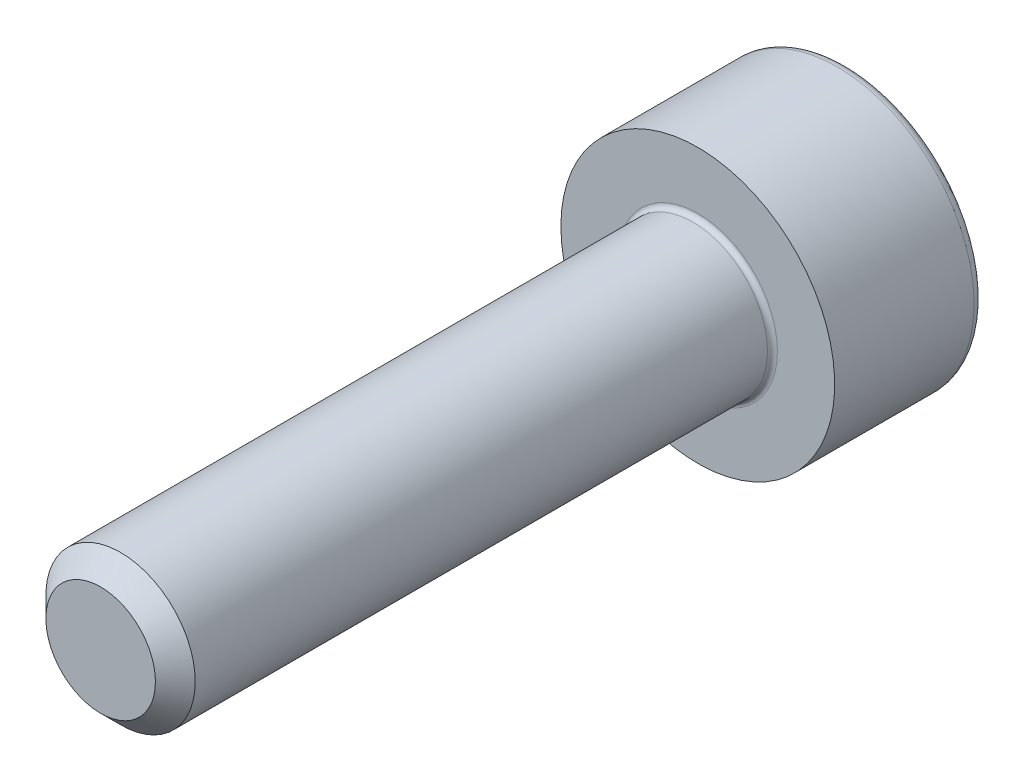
from build123d import *

# Parameters (mm, degrees)
CROQUIS1_W              = 2.75
CROQUIS1_H              = 3
CROQUIS2_R              = 1.5
SALIENTE_EXTRUIR1_DEPTH = 11.995
CORTAR_EXTRUIR1_DEPTH   = 1.5
CHAFL_N1_SIZE           = 0.4
REDONDEO1_R             = 0.1
REDONDEO2_R             = 0.2


with BuildPart() as part:
    # Croquis1 → Revoluci_n1 (revolve)
    with BuildSketch(Plane.XZ.offset(5639.901996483), mode=Mode.PRIVATE) as revoluci_n1_sk:
        with Locations((14696.60052915, -591.500000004)):
            Rectangle(CROQUIS1_W, CROQUIS1_H)
    revolve(revoluci_n1_sk.sketch.rotate(Axis((14695.22552915, -5639.901996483, -590.000000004), (0, 0, -1)), 180), axis=Axis((14695.22552915, -5639.901996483, -590.000000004), (0, 0, -1)))

    # Croquis2 → Saliente-Extruir1 (add)
    with BuildSketch(Plane.XY.offset(-590.000000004)):
        with Locations((14695.22552915, -5639.901996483)):
            Circle(CROQUIS2_R)
    extrude(amount=SALIENTE_EXTRUIR1_DEPTH)

    # Croquis3 → Cortar-Extruir1 (cut)
    with BuildSketch(Plane(origin=(0, 0, -593.000000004), x_dir=(-1, 0, 0), z_dir=(0, 0, -1))):
        Polygon((-14694.503841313, -5638.651996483), (-14695.947216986, -5638.651996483), (-14696.668904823, -5639.901996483), (-14695.947216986, -5641.151996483), (-14694.503841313, -5641.151996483), (-14693.782153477, -5639.901996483), align=None)
    extrude(amount=-CORTAR_EXTRUIR1_DEPTH, mode=Mode.SUBTRACT)

    # Chafl_n1
    chafl_n1_edges = [part.edges().sort_by_distance(p)[0] for p in [
        (14693.72552915, -5639.901996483, -578.005000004),
    ]]
    chamfer(chafl_n1_edges, length=CHAFL_N1_SIZE)

    # Redondeo1
    redondeo1_edges = [part.edges().sort_by_distance(p)[0] for p in [
        (14693.72552915, -5639.901996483, -590.000000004),
    ]]
    fillet(redondeo1_edges, radius=REDONDEO1_R)

    # Redondeo2
    redondeo2_edges = [part.edges().sort_by_distance(p)[0] for p in [
        (14697.97552915, -5639.901996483, -593.000000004),
    ]]
    fillet(redondeo2_edges, radius=REDONDEO2_R)


solid = part.part
